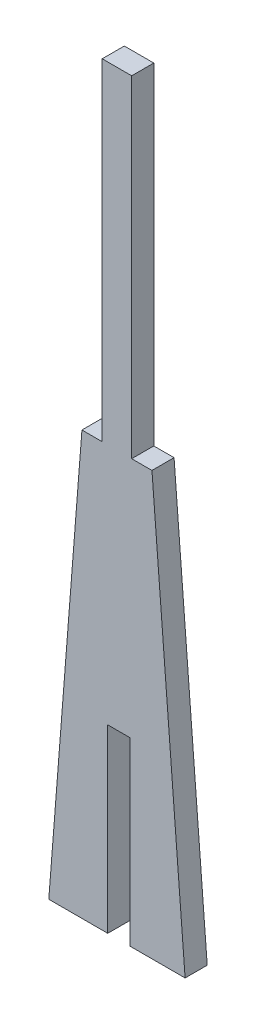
from build123d import *

# Parameters (mm, degrees)
BOSS_EXTRUDE1_DEPTH = 3


with BuildPart() as part:
    # Sketch1 → Boss-Extrude1 (new body)
    with BuildSketch(Plane.XY):
        Polygon((-4.75, 57.4), (-9.25, 0), (-1.25, 0), (-1.25, 24.5), (1.75, 24.5), (1.75, 0), (9.25, 0), (4.75, 57.4), (2, 57.4), (2, 102.4), (-2, 102.4), (-2, 57.4), align=None)
    extrude(amount=BOSS_EXTRUDE1_DEPTH)


solid = part.part
